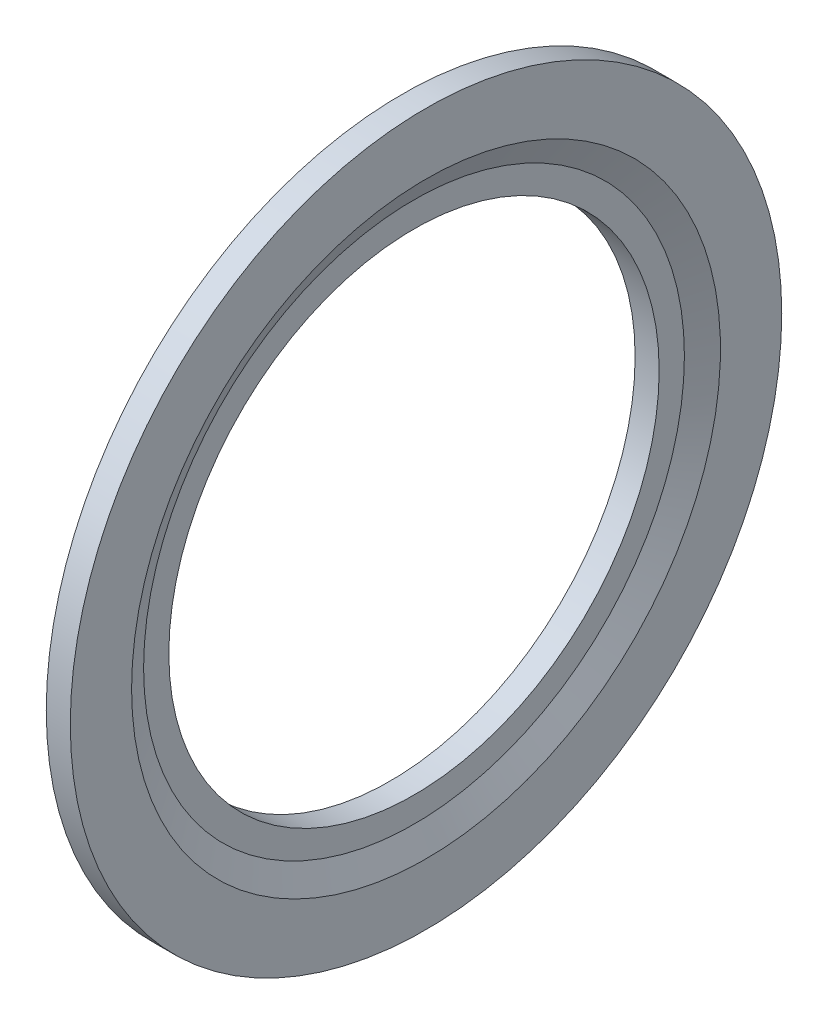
ISO-10303-21;
HEADER;
FILE_DESCRIPTION(('STEP AP214'),'2;1');
FILE_NAME('part.step','',(''),(''),'','','');
FILE_SCHEMA(('AUTOMOTIVE_DESIGN { 1 0 10303 214 1 1 1 1 }'));
ENDSEC;
DATA;
#1=APPLICATION_CONTEXT('core data for automotive mechanical design processes');
#2=APPLICATION_PROTOCOL_DEFINITION('international standard','automotive_design',2000,#1);
#3=PRODUCT_CONTEXT('',#1,'mechanical');
#4=PRODUCT('Part','Part','',(#3));
#5=PRODUCT_RELATED_PRODUCT_CATEGORY('part','',(#4));
#6=PRODUCT_DEFINITION_FORMATION('','',#4);
#7=PRODUCT_DEFINITION_CONTEXT('part definition',#1,'design');
#8=PRODUCT_DEFINITION('design','',#6,#7);
#9=PRODUCT_DEFINITION_SHAPE('','',#8);
#10=(LENGTH_UNIT() NAMED_UNIT(*) SI_UNIT(.MILLI.,.METRE.));
#11=(NAMED_UNIT(*) PLANE_ANGLE_UNIT() SI_UNIT($,.RADIAN.));
#12=(NAMED_UNIT(*) SI_UNIT($,.STERADIAN.) SOLID_ANGLE_UNIT());
#13=UNCERTAINTY_MEASURE_WITH_UNIT(LENGTH_MEASURE(1.E-05),#10,'distance_accuracy_value','');
#14=(GEOMETRIC_REPRESENTATION_CONTEXT(3) GLOBAL_UNCERTAINTY_ASSIGNED_CONTEXT((#13)) GLOBAL_UNIT_ASSIGNED_CONTEXT((#10,
#11,#12)) REPRESENTATION_CONTEXT('',''));
#15=CARTESIAN_POINT('',(0.,0.,0.));
#16=DIRECTION('',(0.,0.,1.));
#17=DIRECTION('',(1.,0.,0.));
#18=AXIS2_PLACEMENT_3D('',#15,#16,#17);
#19=CARTESIAN_POINT('',(0.5,14.8,0.));
#20=DIRECTION('',(1.,0.,0.));
#21=DIRECTION('',(0.,0.,-1.));
#22=AXIS2_PLACEMENT_3D('',#19,#20,#21);
#23=PLANE('',#22);
#24=CARTESIAN_POINT('',(0.5,0.,0.));
#25=DIRECTION('',(-1.,0.,0.));
#26=DIRECTION('',(0.,0.,1.));
#27=AXIS2_PLACEMENT_3D('',#24,#25,#26);
#28=CIRCLE('',#27,12.75);
#29=CARTESIAN_POINT('',(0.5,0.,12.75));
#30=VERTEX_POINT('',#29);
#31=EDGE_CURVE('E32',#30,#30,#28,.T.);
#32=ORIENTED_EDGE('',*,*,#31,.F.);
#33=EDGE_LOOP('',(#32));
#34=FACE_BOUND('',#33,.T.);
#35=CARTESIAN_POINT('',(0.5,0.,0.));
#36=DIRECTION('',(-1.,0.,0.));
#37=DIRECTION('',(0.,0.,1.));
#38=AXIS2_PLACEMENT_3D('',#35,#36,#37);
#39=CIRCLE('',#38,14.8);
#40=CARTESIAN_POINT('',(0.5,0.,14.8));
#41=VERTEX_POINT('',#40);
#42=EDGE_CURVE('E36',#41,#41,#39,.T.);
#43=ORIENTED_EDGE('',*,*,#42,.T.);
#44=EDGE_LOOP('',(#43));
#45=FACE_BOUND('',#44,.T.);
#46=ADVANCED_FACE('F22',(#34,#45),#23,.F.);
#47=CARTESIAN_POINT('',(0.,0.,0.));
#48=DIRECTION('',(-1.,0.,0.));
#49=DIRECTION('',(0.,0.,1.));
#50=AXIS2_PLACEMENT_3D('',#47,#48,#49);
#51=CYLINDRICAL_SURFACE('',#50,14.8);
#52=ORIENTED_EDGE('',*,*,#42,.F.);
#53=EDGE_LOOP('',(#52));
#54=FACE_BOUND('',#53,.T.);
#55=CARTESIAN_POINT('',(1.5,0.,0.));
#56=DIRECTION('',(-1.,0.,0.));
#57=DIRECTION('',(0.,0.,1.));
#58=AXIS2_PLACEMENT_3D('',#55,#56,#57);
#59=CIRCLE('',#58,14.8);
#60=CARTESIAN_POINT('',(1.5,0.,14.8));
#61=VERTEX_POINT('',#60);
#62=EDGE_CURVE('E41',#61,#61,#59,.T.);
#63=ORIENTED_EDGE('',*,*,#62,.T.);
#64=EDGE_LOOP('',(#63));
#65=FACE_BOUND('',#64,.T.);
#66=ADVANCED_FACE('F71',(#54,#65),#51,.T.);
#67=CARTESIAN_POINT('',(1.5,12.25,0.));
#68=DIRECTION('',(-1.,0.,0.));
#69=DIRECTION('',(0.,0.,1.));
#70=AXIS2_PLACEMENT_3D('',#67,#68,#69);
#71=PLANE('',#70);
#72=ORIENTED_EDGE('',*,*,#62,.F.);
#73=EDGE_LOOP('',(#72));
#74=FACE_BOUND('',#73,.T.);
#75=CARTESIAN_POINT('',(1.5,0.,0.));
#76=DIRECTION('',(-1.,0.,0.));
#77=DIRECTION('',(0.,0.,1.));
#78=AXIS2_PLACEMENT_3D('',#75,#76,#77);
#79=CIRCLE('',#78,12.25);
#80=CARTESIAN_POINT('',(1.5,0.,12.25));
#81=VERTEX_POINT('',#80);
#82=EDGE_CURVE('E44',#81,#81,#79,.T.);
#83=ORIENTED_EDGE('',*,*,#82,.T.);
#84=EDGE_LOOP('',(#83));
#85=FACE_BOUND('',#84,.T.);
#86=ADVANCED_FACE('F76',(#74,#85),#71,.F.);
#87=CARTESIAN_POINT('',(1.,10.2,0.));
#88=DIRECTION('',(-1.,0.,0.));
#89=DIRECTION('',(0.,0.,1.));
#90=AXIS2_PLACEMENT_3D('',#87,#88,#89);
#91=PLANE('',#90);
#92=CARTESIAN_POINT('',(1.,0.,0.));
#93=DIRECTION('',(-1.,0.,0.));
#94=DIRECTION('',(0.,0.,1.));
#95=AXIS2_PLACEMENT_3D('',#92,#93,#94);
#96=CIRCLE('',#95,11.25);
#97=CARTESIAN_POINT('',(1.,0.,11.25));
#98=VERTEX_POINT('',#97);
#99=EDGE_CURVE('E10',#98,#98,#96,.F.);
#100=ORIENTED_EDGE('',*,*,#99,.T.);
#101=EDGE_LOOP('',(#100));
#102=FACE_BOUND('',#101,.T.);
#103=CARTESIAN_POINT('',(1.,0.,0.));
#104=DIRECTION('',(-1.,0.,0.));
#105=DIRECTION('',(0.,0.,1.));
#106=AXIS2_PLACEMENT_3D('',#103,#104,#105);
#107=CIRCLE('',#106,10.2);
#108=CARTESIAN_POINT('',(1.,0.,10.2));
#109=VERTEX_POINT('',#108);
#110=EDGE_CURVE('E47',#109,#109,#107,.T.);
#111=ORIENTED_EDGE('',*,*,#110,.T.);
#112=EDGE_LOOP('',(#111));
#113=FACE_BOUND('',#112,.T.);
#114=ADVANCED_FACE('F67',(#102,#113),#91,.F.);
#115=CARTESIAN_POINT('',(0.,0.,0.));
#116=DIRECTION('',(-1.,0.,0.));
#117=DIRECTION('',(0.,0.,1.));
#118=AXIS2_PLACEMENT_3D('',#115,#116,#117);
#119=CYLINDRICAL_SURFACE('',#118,10.2);
#120=ORIENTED_EDGE('',*,*,#110,.F.);
#121=EDGE_LOOP('',(#120));
#122=FACE_BOUND('',#121,.T.);
#123=CARTESIAN_POINT('',(0.,0.,0.));
#124=DIRECTION('',(-1.,0.,0.));
#125=DIRECTION('',(0.,0.,1.));
#126=AXIS2_PLACEMENT_3D('',#123,#124,#125);
#127=CIRCLE('',#126,10.2);
#128=CARTESIAN_POINT('',(0.,0.,10.2));
#129=VERTEX_POINT('',#128);
#130=EDGE_CURVE('E50',#129,#129,#127,.T.);
#131=ORIENTED_EDGE('',*,*,#130,.T.);
#132=EDGE_LOOP('',(#131));
#133=FACE_BOUND('',#132,.T.);
#134=ADVANCED_FACE('F54',(#122,#133),#119,.F.);
#135=CARTESIAN_POINT('',(0.,12.75,0.));
#136=DIRECTION('',(1.,0.,0.));
#137=DIRECTION('',(0.,0.,-1.));
#138=AXIS2_PLACEMENT_3D('',#135,#136,#137);
#139=PLANE('',#138);
#140=CARTESIAN_POINT('',(0.,0.,0.));
#141=DIRECTION('',(1.,0.,0.));
#142=DIRECTION('',(0.,0.,-1.));
#143=AXIS2_PLACEMENT_3D('',#140,#141,#142);
#144=CIRCLE('',#143,11.75);
#145=CARTESIAN_POINT('',(0.,0.,-11.75));
#146=VERTEX_POINT('',#145);
#147=EDGE_CURVE('E28',#146,#146,#144,.F.);
#148=ORIENTED_EDGE('',*,*,#147,.T.);
#149=EDGE_LOOP('',(#148));
#150=FACE_BOUND('',#149,.T.);
#151=ORIENTED_EDGE('',*,*,#130,.F.);
#152=EDGE_LOOP('',(#151));
#153=FACE_BOUND('',#152,.T.);
#154=ADVANCED_FACE('F56',(#150,#153),#139,.F.);
#155=CARTESIAN_POINT('',(0.,0.,0.));
#156=DIRECTION('',(1.,0.,0.));
#157=DIRECTION('',(0.,0.,-1.));
#158=AXIS2_PLACEMENT_3D('',#155,#156,#157);
#159=CONICAL_SURFACE('',#158,11.75,1.10714871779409);
#160=ORIENTED_EDGE('',*,*,#31,.T.);
#161=EDGE_LOOP('',(#160));
#162=FACE_BOUND('',#161,.T.);
#163=ORIENTED_EDGE('',*,*,#147,.F.);
#164=EDGE_LOOP('',(#163));
#165=FACE_BOUND('',#164,.T.);
#166=ADVANCED_FACE('F58',(#162,#165),#159,.T.);
#167=CARTESIAN_POINT('',(1.5,0.,0.));
#168=DIRECTION('',(1.,0.,0.));
#169=DIRECTION('',(0.,0.,-1.));
#170=AXIS2_PLACEMENT_3D('',#167,#168,#169);
#171=CONICAL_SURFACE('',#170,12.25,1.10714871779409);
#172=ORIENTED_EDGE('',*,*,#99,.F.);
#173=EDGE_LOOP('',(#172));
#174=FACE_BOUND('',#173,.T.);
#175=ORIENTED_EDGE('',*,*,#82,.F.);
#176=EDGE_LOOP('',(#175));
#177=FACE_BOUND('',#176,.T.);
#178=ADVANCED_FACE('F64',(#174,#177),#171,.F.);
#179=CLOSED_SHELL('',(#46,#66,#86,#114,#134,#154,#166,#178));
#180=MANIFOLD_SOLID_BREP('B2',#179);
#181=ADVANCED_BREP_SHAPE_REPRESENTATION('',(#18,#180),#14);
#182=SHAPE_DEFINITION_REPRESENTATION(#9,#181);
ENDSEC;
END-ISO-10303-21;
